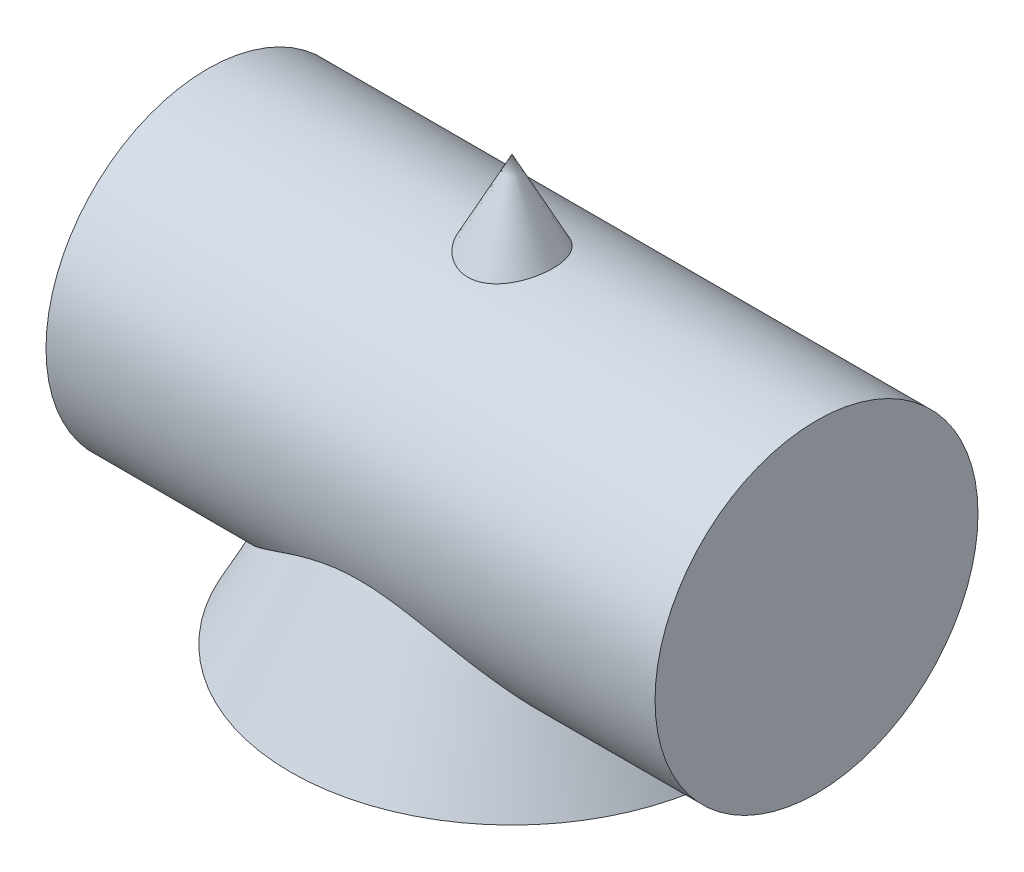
from build123d import *

# Parameters (mm, degrees)
SKETCH_2_R      = 17.5
EXTRUDE_1_DEPTH = 33


with BuildPart() as part:
    # Sketch 1 → Revolve 1 (revolve)
    with BuildSketch(Plane.XY, mode=Mode.PRIVATE) as revolve_1_sk:
        Polygon((0, 0), (-24, 0), (0, 46), align=None)
    revolve(revolve_1_sk.sketch.rotate(Axis((0, 0, 0), (0, -1, 0)), 90), axis=Axis((0, 0, 0), (0, -1, 0)))

    # Sketch 2 → Extrude 1 (add, symmetric)
    with BuildSketch(Plane(origin=(0, 0, 0), x_dir=(0, 0, -1), z_dir=(1, 0, 0))):
        with Locations((0, 20)):
            Circle(SKETCH_2_R)
    extrude(amount=EXTRUDE_1_DEPTH, both=True)


solid = part.part
